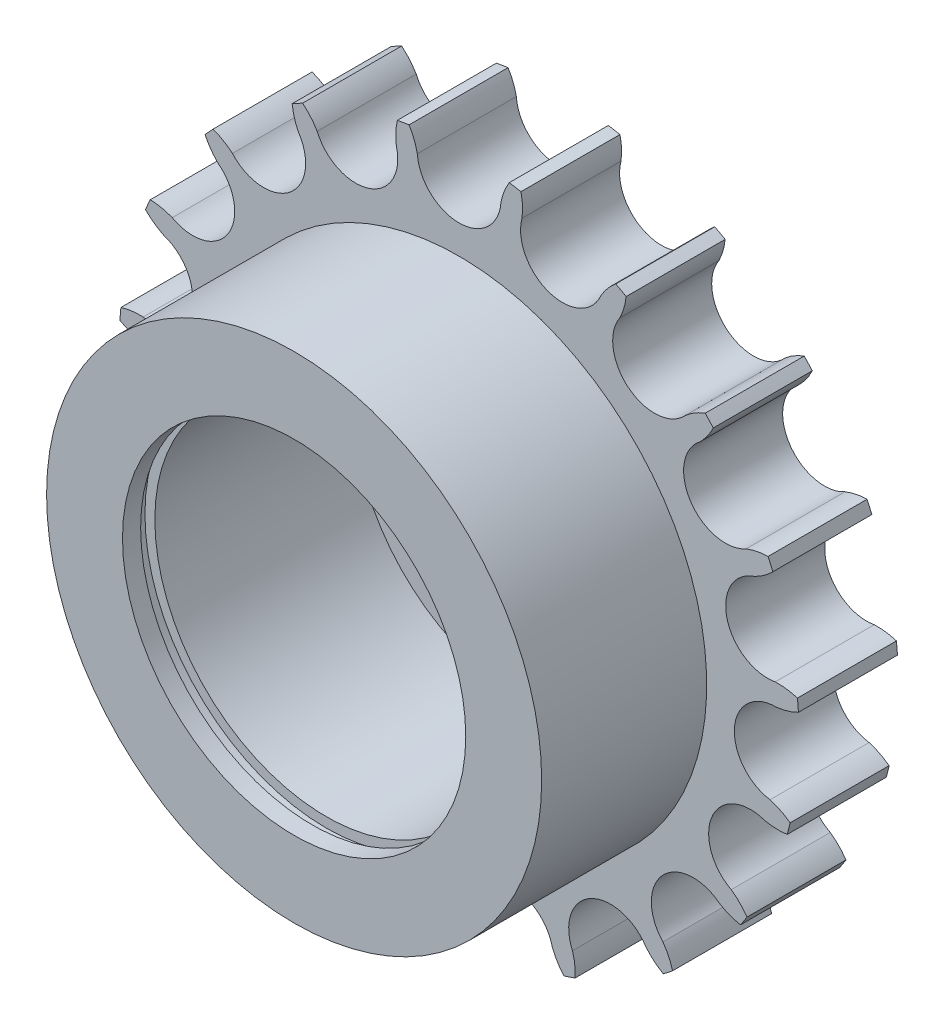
from build123d import *

# Parameters (mm, degrees)
ESQUISSE1_R             = 17.5
BASE_EXTRUSION_DEPTH    = 15
ESQUISSE3_R             = 37.5
BOSS_EXTRU_1_DEPTH      = 25
ESQUISSE4_R             = 26
ENL_V_MAT_EXTRU_1_DEPTH = 35
ESQUISSE5_R             = 27.5
ENL_V_MAT_EXTRU_2_DEPTH = 2.15


with BuildPart() as part:
    # Esquisse1 → Base-Extrusion (new body)
    with BuildSketch(Plane.XY):
        with BuildLine():
            ThreePointArc((9.521345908, 47.248449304), (13.588672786, 39.582451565), (21.506918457, 43.133797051))
            ThreePointArc((21.506918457, 43.133797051), (22.495552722, 44.52306987), (23.715043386, 45.714841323))
            ThreePointArc((23.715043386, 45.714841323), (24.511290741, 45.292898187), (25.300033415, 44.857087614))
            ThreePointArc((25.300033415, 44.857087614), (24.969320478, 43.184333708), (24.346999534, 41.596822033))
            ThreePointArc((24.346999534, 41.596822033), (25.704802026, 33.025530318), (34.3471353, 33.813403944))
            ThreePointArc((34.3471353, 33.813403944), (35.73329878, 34.806393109), (37.273681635, 35.537623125))
            ThreePointArc((37.273681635, 35.537623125), (37.8897814, 34.880000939), (38.494280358, 34.211699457))
            ThreePointArc((38.494280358, 34.211699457), (37.638344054, 32.736962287), (36.534277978, 31.437533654))
            ThreePointArc((36.534277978, 31.437533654), (35.035417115, 22.889780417), (43.465307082, 20.82880385))
            ThreePointArc((43.465307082, 20.82880385), (45.098787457, 21.317903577), (46.793138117, 21.509352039))
            ThreePointArc((46.793138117, 21.509352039), (47.162326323, 20.68731437), (47.517074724, 19.858942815))
            ThreePointArc((47.517074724, 19.858942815), (46.228669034, 18.742033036), (44.762500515, 17.871500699))
            ThreePointArc((44.762500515, 17.871500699), (40.56940113, 10.273567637), (47.873338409, 5.587079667))
            ThreePointArc((47.873338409, 5.587079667), (49.577122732, 5.519288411), (51.241832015, 5.150208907))
            ThreePointArc((51.241832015, 5.150208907), (51.32410139, 4.252836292), (51.39065674, 3.354161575))
            ThreePointArc((51.39065674, 3.354161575), (49.809400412, 2.716113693), (48.14001156, 2.368813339))
            ThreePointArc((48.14001156, 2.368813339), (41.707061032, -3.455945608), (47.093550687, -10.260091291))
            ThreePointArc((47.093550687, -10.260091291), (48.683007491, -10.877427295), (50.137678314, -11.767039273))
            ThreePointArc((50.137678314, -11.767039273), (49.924113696, -12.642502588), (49.69526369, -13.514095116))
            ThreePointArc((49.69526369, -13.514095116), (47.992510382, -13.604138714), (46.300805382, -13.390571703))
            ThreePointArc((46.300805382, -13.390571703), (38.325113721, -16.810953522), (41.210446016, -24.995422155))
            ThreePointArc((41.210446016, -24.995422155), (42.513332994, -26.095404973), (43.600329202, -27.409146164))
            ThreePointArc((43.600329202, -27.409146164), (43.114073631, -28.167830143), (42.614617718, -28.917889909))
            ThreePointArc((42.614617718, -28.917889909), (40.974887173, -28.450171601), (39.444188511, -27.698880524))
            ThreePointArc((39.444188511, -27.698880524), (30.790045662, -28.344233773), (30.861550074, -37.022111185))
            ThreePointArc((30.861550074, -37.022111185), (31.736679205, -38.48554061), (32.338207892, -40.081046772))
            ThreePointArc((32.338207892, -40.081046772), (31.631954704, -40.640736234), (30.916016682, -41.187982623))
            ThreePointArc((30.916016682, -41.187982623), (29.516999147, -40.213186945), (28.313181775, -39.005585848))
            ThreePointArc((28.313181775, -39.005585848), (19.918398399, -36.805976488), (17.168326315, -45.036880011))
            ThreePointArc((17.168326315, -45.036880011), (17.520863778, -46.705170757), (17.571739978, -48.40954404))
            ThreePointArc((17.571739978, -48.40954404), (16.722022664, -48.709587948), (15.867185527, -48.994718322))
            ThreePointArc((15.867185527, -48.994718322), (14.86048626, -47.618479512), (14.114002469, -46.085430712))
            ThreePointArc((14.114002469, -46.085430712), (6.888283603, -41.279220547), (1.614648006, -48.171204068))
            ThreePointArc((1.614648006, -48.171204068), (1.406390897, -49.863570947), (0.901101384, -51.49211606))
            ThreePointArc((0.901101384, -51.49211606), (0, -51.5), (-0.901101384, -51.49211606))
            ThreePointArc((-0.901101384, -51.49211606), (-1.406390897, -49.863570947), (-1.614648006, -48.171204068))
            ThreePointArc((-1.614648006, -48.171204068), (-6.888283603, -41.279220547), (-14.114002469, -46.085430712))
            ThreePointArc((-14.114002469, -46.085430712), (-14.86048626, -47.618479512), (-15.867185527, -48.994718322))
            ThreePointArc((-15.867185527, -48.994718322), (-16.722022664, -48.709587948), (-17.571739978, -48.40954404))
            ThreePointArc((-17.571739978, -48.40954404), (-17.520863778, -46.705170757), (-17.168326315, -45.036880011))
            ThreePointArc((-17.168326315, -45.036880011), (-19.918398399, -36.805976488), (-28.313181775, -39.005585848))
            ThreePointArc((-28.313181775, -39.005585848), (-29.516999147, -40.213186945), (-30.916016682, -41.187982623))
            ThreePointArc((-30.916016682, -41.187982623), (-31.631954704, -40.640736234), (-32.338207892, -40.081046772))
            ThreePointArc((-32.338207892, -40.081046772), (-31.736679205, -38.48554061), (-30.861550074, -37.022111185))
            ThreePointArc((-30.861550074, -37.022111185), (-30.790045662, -28.344233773), (-39.444188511, -27.698880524))
            ThreePointArc((-39.444188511, -27.698880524), (-40.974887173, -28.450171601), (-42.614617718, -28.917889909))
            ThreePointArc((-42.614617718, -28.917889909), (-43.114073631, -28.167830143), (-43.600329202, -27.409146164))
            ThreePointArc((-43.600329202, -27.409146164), (-42.513332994, -26.095404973), (-41.210446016, -24.995422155))
            ThreePointArc((-41.210446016, -24.995422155), (-38.325113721, -16.810953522), (-46.300805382, -13.390571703))
            ThreePointArc((-46.300805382, -13.390571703), (-47.992510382, -13.604138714), (-49.69526369, -13.514095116))
            ThreePointArc((-49.69526369, -13.514095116), (-49.924113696, -12.642502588), (-50.137678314, -11.767039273))
            ThreePointArc((-50.137678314, -11.767039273), (-48.683007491, -10.877427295), (-47.093550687, -10.260091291))
            ThreePointArc((-47.093550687, -10.260091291), (-41.707061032, -3.455945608), (-48.14001156, 2.368813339))
            ThreePointArc((-48.14001156, 2.368813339), (-49.809400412, 2.716113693), (-51.39065674, 3.354161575))
            ThreePointArc((-51.39065674, 3.354161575), (-51.32410139, 4.252836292), (-51.241832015, 5.150208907))
            ThreePointArc((-51.241832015, 5.150208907), (-49.577122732, 5.519288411), (-47.873338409, 5.587079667))
            ThreePointArc((-47.873338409, 5.587079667), (-40.56940113, 10.273567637), (-44.762500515, 17.871500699))
            ThreePointArc((-44.762500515, 17.871500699), (-46.228669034, 18.742033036), (-47.517074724, 19.858942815))
            ThreePointArc((-47.517074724, 19.858942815), (-47.162326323, 20.68731437), (-46.793138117, 21.509352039))
            ThreePointArc((-46.793138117, 21.509352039), (-45.098787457, 21.317903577), (-43.465307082, 20.82880385))
            ThreePointArc((-43.465307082, 20.82880385), (-35.035417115, 22.889780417), (-36.534277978, 31.437533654))
            ThreePointArc((-36.534277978, 31.437533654), (-37.638344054, 32.736962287), (-38.494280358, 34.211699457))
            ThreePointArc((-38.494280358, 34.211699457), (-37.8897814, 34.880000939), (-37.273681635, 35.537623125))
            ThreePointArc((-37.273681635, 35.537623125), (-35.73329878, 34.806393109), (-34.3471353, 33.813403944))
            ThreePointArc((-34.3471353, 33.813403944), (-25.704802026, 33.025530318), (-24.346999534, 41.596822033))
            ThreePointArc((-24.346999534, 41.596822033), (-24.969320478, 43.184333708), (-25.300033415, 44.857087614))
            ThreePointArc((-25.300033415, 44.857087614), (-24.511290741, 45.292898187), (-23.715043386, 45.714841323))
            ThreePointArc((-23.715043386, 45.714841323), (-22.495552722, 44.52306987), (-21.506918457, 43.133797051))
            ThreePointArc((-21.506918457, 43.133797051), (-13.588672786, 39.582451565), (-9.521345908, 47.248449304))
            ThreePointArc((-9.521345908, 47.248449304), (-9.594483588, 48.952012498), (-9.364135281, 50.641514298))
            ThreePointArc((-9.364135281, 50.641514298), (-8.476621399, 50.797607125), (-7.58651221, 50.938147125))
            ThreePointArc((-7.58651221, 50.938147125), (-6.820064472, 49.414981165), (-6.336093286, 47.779973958))
            ThreePointArc((-6.336093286, 47.779973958), (0, 41.85), (6.336093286, 47.779973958))
            ThreePointArc((6.336093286, 47.779973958), (6.820064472, 49.414981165), (7.58651221, 50.938147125))
            ThreePointArc((7.58651221, 50.938147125), (8.476621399, 50.797607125), (9.364135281, 50.641514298))
            ThreePointArc((9.364135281, 50.641514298), (9.594483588, 48.952012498), (9.521345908, 47.248449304))
        make_face()
        Circle(ESQUISSE1_R, mode=Mode.SUBTRACT)
    extrude(amount=BASE_EXTRUSION_DEPTH)

    # Esquisse3 → Boss.-Extru.1 (add)
    with BuildSketch(Plane.XY.offset(15)):
        with Locations(Location((0, 0, 0), (0, 0, 180))):
            Circle(ESQUISSE3_R)
    extrude(amount=BOSS_EXTRU_1_DEPTH)

    # Esquisse4 → Enl_v. mat.-Extru.1 (cut)
    with BuildSketch(Plane.XY.offset(40)):
        Circle(ESQUISSE4_R)
    extrude(amount=-ENL_V_MAT_EXTRU_1_DEPTH, mode=Mode.SUBTRACT)

    # Esquisse5 → Enl_v. mat.-Extru.2 (cut)
    with BuildSketch(Plane.XY.offset(37.25)):
        Circle(ESQUISSE5_R)
    extrude(amount=-ENL_V_MAT_EXTRU_2_DEPTH, mode=Mode.SUBTRACT)


solid = part.part
